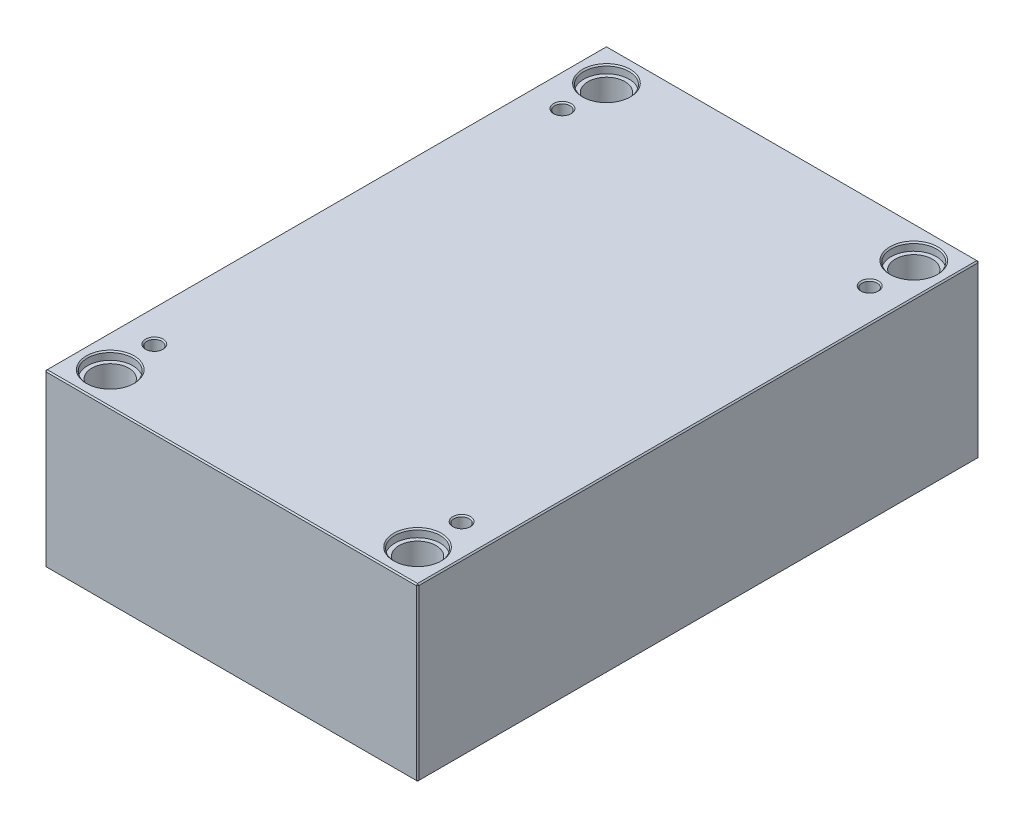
ISO-10303-21;
HEADER;
FILE_DESCRIPTION(('STEP AP214'),'2;1');
FILE_NAME('part.step','',(''),(''),'','','');
FILE_SCHEMA(('AUTOMOTIVE_DESIGN { 1 0 10303 214 1 1 1 1 }'));
ENDSEC;
DATA;
#1=APPLICATION_CONTEXT('core data for automotive mechanical design processes');
#2=APPLICATION_PROTOCOL_DEFINITION('international standard','automotive_design',2000,#1);
#3=PRODUCT_CONTEXT('',#1,'mechanical');
#4=PRODUCT('Part','Part','',(#3));
#5=PRODUCT_RELATED_PRODUCT_CATEGORY('part','',(#4));
#6=PRODUCT_DEFINITION_FORMATION('','',#4);
#7=PRODUCT_DEFINITION_CONTEXT('part definition',#1,'design');
#8=PRODUCT_DEFINITION('design','',#6,#7);
#9=PRODUCT_DEFINITION_SHAPE('','',#8);
#10=(LENGTH_UNIT() NAMED_UNIT(*) SI_UNIT(.MILLI.,.METRE.));
#11=(NAMED_UNIT(*) PLANE_ANGLE_UNIT() SI_UNIT($,.RADIAN.));
#12=(NAMED_UNIT(*) SI_UNIT($,.STERADIAN.) SOLID_ANGLE_UNIT());
#13=UNCERTAINTY_MEASURE_WITH_UNIT(LENGTH_MEASURE(1.E-05),#10,'distance_accuracy_value','');
#14=(GEOMETRIC_REPRESENTATION_CONTEXT(3) GLOBAL_UNCERTAINTY_ASSIGNED_CONTEXT((#13)) GLOBAL_UNIT_ASSIGNED_CONTEXT((#10,
#11,#12)) REPRESENTATION_CONTEXT('',''));
#15=CARTESIAN_POINT('',(0.,0.,0.));
#16=DIRECTION('',(0.,0.,1.));
#17=DIRECTION('',(1.,0.,0.));
#18=AXIS2_PLACEMENT_3D('',#15,#16,#17);
#19=CARTESIAN_POINT('',(-122.,0.,-197.));
#20=DIRECTION('',(0.,1.,0.));
#21=DIRECTION('',(0.,0.,1.));
#22=AXIS2_PLACEMENT_3D('',#19,#20,#21);
#23=CYLINDRICAL_SURFACE('',#22,14.7);
#24=CARTESIAN_POINT('',(-122.,1.00000000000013,-197.));
#25=DIRECTION('',(0.,1.,0.));
#26=DIRECTION('',(0.,0.,1.));
#27=AXIS2_PLACEMENT_3D('',#24,#25,#26);
#28=CIRCLE('',#27,14.7);
#29=CARTESIAN_POINT('',(-122.,1.00000000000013,-182.3));
#30=VERTEX_POINT('',#29);
#31=EDGE_CURVE('E471',#30,#30,#28,.F.);
#32=ORIENTED_EDGE('',*,*,#31,.T.);
#33=EDGE_LOOP('',(#32));
#34=FACE_BOUND('',#33,.T.);
#35=CARTESIAN_POINT('',(-122.,129.7,-197.));
#36=DIRECTION('',(0.,1.,0.));
#37=DIRECTION('',(0.,0.,1.));
#38=AXIS2_PLACEMENT_3D('',#35,#36,#37);
#39=CIRCLE('',#38,14.7);
#40=CARTESIAN_POINT('',(-122.,129.7,-182.3));
#41=VERTEX_POINT('',#40);
#42=EDGE_CURVE('E220',#41,#41,#39,.F.);
#43=ORIENTED_EDGE('',*,*,#42,.F.);
#44=EDGE_LOOP('',(#43));
#45=FACE_BOUND('',#44,.T.);
#46=ADVANCED_FACE('F15',(#34,#45),#23,.F.);
#47=CARTESIAN_POINT('',(122.,0.,-197.));
#48=DIRECTION('',(0.,1.,0.));
#49=DIRECTION('',(0.,0.,1.));
#50=AXIS2_PLACEMENT_3D('',#47,#48,#49);
#51=CYLINDRICAL_SURFACE('',#50,14.7);
#52=CARTESIAN_POINT('',(122.,1.00000000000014,-197.));
#53=DIRECTION('',(0.,1.,0.));
#54=DIRECTION('',(0.,0.,1.));
#55=AXIS2_PLACEMENT_3D('',#52,#53,#54);
#56=CIRCLE('',#55,14.7);
#57=CARTESIAN_POINT('',(122.,1.00000000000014,-182.3));
#58=VERTEX_POINT('',#57);
#59=EDGE_CURVE('E473',#58,#58,#56,.F.);
#60=ORIENTED_EDGE('',*,*,#59,.T.);
#61=EDGE_LOOP('',(#60));
#62=FACE_BOUND('',#61,.T.);
#63=CARTESIAN_POINT('',(122.,129.7,-197.));
#64=DIRECTION('',(0.,1.,0.));
#65=DIRECTION('',(0.,0.,1.));
#66=AXIS2_PLACEMENT_3D('',#63,#64,#65);
#67=CIRCLE('',#66,14.7);
#68=CARTESIAN_POINT('',(122.,129.7,-182.3));
#69=VERTEX_POINT('',#68);
#70=EDGE_CURVE('E217',#69,#69,#67,.F.);
#71=ORIENTED_EDGE('',*,*,#70,.F.);
#72=EDGE_LOOP('',(#71));
#73=FACE_BOUND('',#72,.T.);
#74=ADVANCED_FACE('F262',(#62,#73),#51,.F.);
#75=CARTESIAN_POINT('',(122.,0.,197.));
#76=DIRECTION('',(0.,1.,0.));
#77=DIRECTION('',(0.,0.,1.));
#78=AXIS2_PLACEMENT_3D('',#75,#76,#77);
#79=CYLINDRICAL_SURFACE('',#78,14.7);
#80=CARTESIAN_POINT('',(122.,1.00000000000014,197.));
#81=DIRECTION('',(0.,1.,0.));
#82=DIRECTION('',(0.,0.,1.));
#83=AXIS2_PLACEMENT_3D('',#80,#81,#82);
#84=CIRCLE('',#83,14.7);
#85=CARTESIAN_POINT('',(122.,1.00000000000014,211.7));
#86=VERTEX_POINT('',#85);
#87=EDGE_CURVE('E476',#86,#86,#84,.F.);
#88=ORIENTED_EDGE('',*,*,#87,.T.);
#89=EDGE_LOOP('',(#88));
#90=FACE_BOUND('',#89,.T.);
#91=CARTESIAN_POINT('',(122.,129.7,197.));
#92=DIRECTION('',(0.,1.,0.));
#93=DIRECTION('',(0.,0.,1.));
#94=AXIS2_PLACEMENT_3D('',#91,#92,#93);
#95=CIRCLE('',#94,14.7);
#96=CARTESIAN_POINT('',(122.,129.7,211.7));
#97=VERTEX_POINT('',#96);
#98=EDGE_CURVE('E213',#97,#97,#95,.F.);
#99=ORIENTED_EDGE('',*,*,#98,.F.);
#100=EDGE_LOOP('',(#99));
#101=FACE_BOUND('',#100,.T.);
#102=ADVANCED_FACE('F269',(#90,#101),#79,.F.);
#103=CARTESIAN_POINT('',(-122.,0.,197.));
#104=DIRECTION('',(0.,1.,0.));
#105=DIRECTION('',(0.,0.,1.));
#106=AXIS2_PLACEMENT_3D('',#103,#104,#105);
#107=CYLINDRICAL_SURFACE('',#106,14.7);
#108=CARTESIAN_POINT('',(-122.,0.999999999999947,197.));
#109=DIRECTION('',(0.,1.,0.));
#110=DIRECTION('',(0.,0.,1.));
#111=AXIS2_PLACEMENT_3D('',#108,#109,#110);
#112=CIRCLE('',#111,14.7);
#113=CARTESIAN_POINT('',(-122.,0.999999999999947,211.7));
#114=VERTEX_POINT('',#113);
#115=EDGE_CURVE('E479',#114,#114,#112,.F.);
#116=ORIENTED_EDGE('',*,*,#115,.T.);
#117=EDGE_LOOP('',(#116));
#118=FACE_BOUND('',#117,.T.);
#119=CARTESIAN_POINT('',(-122.,129.7,197.));
#120=DIRECTION('',(0.,1.,0.));
#121=DIRECTION('',(0.,0.,1.));
#122=AXIS2_PLACEMENT_3D('',#119,#120,#121);
#123=CIRCLE('',#122,14.7);
#124=CARTESIAN_POINT('',(-122.,129.7,211.7));
#125=VERTEX_POINT('',#124);
#126=EDGE_CURVE('E210',#125,#125,#123,.F.);
#127=ORIENTED_EDGE('',*,*,#126,.F.);
#128=EDGE_LOOP('',(#127));
#129=FACE_BOUND('',#128,.T.);
#130=ADVANCED_FACE('F276',(#118,#129),#107,.F.);
#131=CARTESIAN_POINT('',(-148.,136.,223.));
#132=DIRECTION('',(1.,0.,0.));
#133=DIRECTION('',(0.,0.,-1.));
#134=AXIS2_PLACEMENT_3D('',#131,#132,#133);
#135=PLANE('',#134);
#136=DIRECTION('',(0.,-1.,0.));
#137=VECTOR('',#136,1.);
#138=CARTESIAN_POINT('',(-148.,136.,-222.));
#139=LINE('',#138,#137);
#140=CARTESIAN_POINT('',(-148.,135.,-222.));
#141=VERTEX_POINT('',#140);
#142=CARTESIAN_POINT('',(-148.,1.00000000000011,-222.));
#143=VERTEX_POINT('',#142);
#144=EDGE_CURVE('E486',#141,#143,#139,.T.);
#145=ORIENTED_EDGE('',*,*,#144,.T.);
#146=DIRECTION('',(0.,0.,1.));
#147=VECTOR('',#146,1.);
#148=CARTESIAN_POINT('',(-148.,1.00000000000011,223.));
#149=LINE('',#148,#147);
#150=CARTESIAN_POINT('',(-148.,1.00000000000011,222.));
#151=VERTEX_POINT('',#150);
#152=EDGE_CURVE('E489',#143,#151,#149,.T.);
#153=ORIENTED_EDGE('',*,*,#152,.T.);
#154=DIRECTION('',(0.,1.,0.));
#155=VECTOR('',#154,1.);
#156=CARTESIAN_POINT('',(-148.,136.,222.));
#157=LINE('',#156,#155);
#158=CARTESIAN_POINT('',(-148.,135.,222.));
#159=VERTEX_POINT('',#158);
#160=EDGE_CURVE('E484',#151,#159,#157,.T.);
#161=ORIENTED_EDGE('',*,*,#160,.T.);
#162=DIRECTION('',(0.,0.,-1.));
#163=VECTOR('',#162,1.);
#164=CARTESIAN_POINT('',(-148.,135.,-223.));
#165=LINE('',#164,#163);
#166=EDGE_CURVE('E482',#159,#141,#165,.T.);
#167=ORIENTED_EDGE('',*,*,#166,.T.);
#168=EDGE_LOOP('',(#145,#153,#161,#167));
#169=FACE_BOUND('',#168,.T.);
#170=ADVANCED_FACE('F297',(#169),#135,.F.);
#171=CARTESIAN_POINT('',(148.,136.,223.));
#172=DIRECTION('',(0.,0.,-1.));
#173=DIRECTION('',(-1.,0.,0.));
#174=AXIS2_PLACEMENT_3D('',#171,#172,#173);
#175=PLANE('',#174);
#176=DIRECTION('',(-1.,0.,0.));
#177=VECTOR('',#176,1.);
#178=CARTESIAN_POINT('',(-148.,135.,223.));
#179=LINE('',#178,#177);
#180=CARTESIAN_POINT('',(147.,135.,223.));
#181=VERTEX_POINT('',#180);
#182=CARTESIAN_POINT('',(-147.,135.,223.));
#183=VERTEX_POINT('',#182);
#184=EDGE_CURVE('E508',#181,#183,#179,.T.);
#185=ORIENTED_EDGE('',*,*,#184,.T.);
#186=DIRECTION('',(0.,-1.,0.));
#187=VECTOR('',#186,1.);
#188=CARTESIAN_POINT('',(-147.,136.,223.));
#189=LINE('',#188,#187);
#190=CARTESIAN_POINT('',(-147.,1.00000000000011,223.));
#191=VERTEX_POINT('',#190);
#192=EDGE_CURVE('E514',#183,#191,#189,.T.);
#193=ORIENTED_EDGE('',*,*,#192,.T.);
#194=DIRECTION('',(1.,0.,0.));
#195=VECTOR('',#194,1.);
#196=CARTESIAN_POINT('',(148.,1.00000000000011,223.));
#197=LINE('',#196,#195);
#198=CARTESIAN_POINT('',(147.,1.00000000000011,223.));
#199=VERTEX_POINT('',#198);
#200=EDGE_CURVE('E512',#191,#199,#197,.T.);
#201=ORIENTED_EDGE('',*,*,#200,.T.);
#202=DIRECTION('',(0.,1.,0.));
#203=VECTOR('',#202,1.);
#204=CARTESIAN_POINT('',(147.,136.,223.));
#205=LINE('',#204,#203);
#206=EDGE_CURVE('E510',#199,#181,#205,.T.);
#207=ORIENTED_EDGE('',*,*,#206,.T.);
#208=EDGE_LOOP('',(#185,#193,#201,#207));
#209=FACE_BOUND('',#208,.T.);
#210=ADVANCED_FACE('F293',(#209),#175,.F.);
#211=CARTESIAN_POINT('',(148.,136.,223.));
#212=DIRECTION('',(-1.,0.,0.));
#213=DIRECTION('',(0.,0.,1.));
#214=AXIS2_PLACEMENT_3D('',#211,#212,#213);
#215=PLANE('',#214);
#216=DIRECTION('',(0.,0.,-1.));
#217=VECTOR('',#216,1.);
#218=CARTESIAN_POINT('',(148.,1.00000000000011,223.));
#219=LINE('',#218,#217);
#220=CARTESIAN_POINT('',(148.,1.00000000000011,222.));
#221=VERTEX_POINT('',#220);
#222=CARTESIAN_POINT('',(148.,1.00000000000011,-222.));
#223=VERTEX_POINT('',#222);
#224=EDGE_CURVE('E503',#221,#223,#219,.T.);
#225=ORIENTED_EDGE('',*,*,#224,.T.);
#226=DIRECTION('',(0.,1.,0.));
#227=VECTOR('',#226,1.);
#228=CARTESIAN_POINT('',(148.,136.,-222.));
#229=LINE('',#228,#227);
#230=CARTESIAN_POINT('',(148.,135.,-222.));
#231=VERTEX_POINT('',#230);
#232=EDGE_CURVE('E505',#223,#231,#229,.T.);
#233=ORIENTED_EDGE('',*,*,#232,.T.);
#234=DIRECTION('',(0.,0.,1.));
#235=VECTOR('',#234,1.);
#236=CARTESIAN_POINT('',(148.,135.,223.));
#237=LINE('',#236,#235);
#238=CARTESIAN_POINT('',(148.,135.,222.));
#239=VERTEX_POINT('',#238);
#240=EDGE_CURVE('E499',#231,#239,#237,.T.);
#241=ORIENTED_EDGE('',*,*,#240,.T.);
#242=DIRECTION('',(0.,-1.,0.));
#243=VECTOR('',#242,1.);
#244=CARTESIAN_POINT('',(148.,136.,222.));
#245=LINE('',#244,#243);
#246=EDGE_CURVE('E501',#239,#221,#245,.T.);
#247=ORIENTED_EDGE('',*,*,#246,.T.);
#248=EDGE_LOOP('',(#225,#233,#241,#247));
#249=FACE_BOUND('',#248,.T.);
#250=ADVANCED_FACE('F289',(#249),#215,.F.);
#251=CARTESIAN_POINT('',(148.,136.,-223.));
#252=DIRECTION('',(0.,0.,1.));
#253=DIRECTION('',(1.,0.,0.));
#254=AXIS2_PLACEMENT_3D('',#251,#252,#253);
#255=PLANE('',#254);
#256=DIRECTION('',(0.,-1.,0.));
#257=VECTOR('',#256,1.);
#258=CARTESIAN_POINT('',(147.,136.,-223.));
#259=LINE('',#258,#257);
#260=CARTESIAN_POINT('',(147.,135.,-223.));
#261=VERTEX_POINT('',#260);
#262=CARTESIAN_POINT('',(147.,1.00000000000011,-223.));
#263=VERTEX_POINT('',#262);
#264=EDGE_CURVE('E493',#261,#263,#259,.T.);
#265=ORIENTED_EDGE('',*,*,#264,.T.);
#266=DIRECTION('',(-1.,0.,0.));
#267=VECTOR('',#266,1.);
#268=CARTESIAN_POINT('',(148.,1.00000000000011,-223.));
#269=LINE('',#268,#267);
#270=CARTESIAN_POINT('',(-147.,1.00000000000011,-223.));
#271=VERTEX_POINT('',#270);
#272=EDGE_CURVE('E137',#263,#271,#269,.T.);
#273=ORIENTED_EDGE('',*,*,#272,.T.);
#274=DIRECTION('',(0.,1.,0.));
#275=VECTOR('',#274,1.);
#276=CARTESIAN_POINT('',(-147.,136.,-223.));
#277=LINE('',#276,#275);
#278=CARTESIAN_POINT('',(-147.,135.,-223.));
#279=VERTEX_POINT('',#278);
#280=EDGE_CURVE('E495',#271,#279,#277,.T.);
#281=ORIENTED_EDGE('',*,*,#280,.T.);
#282=DIRECTION('',(1.,0.,0.));
#283=VECTOR('',#282,1.);
#284=CARTESIAN_POINT('',(148.,135.,-223.));
#285=LINE('',#284,#283);
#286=EDGE_CURVE('E491',#279,#261,#285,.T.);
#287=ORIENTED_EDGE('',*,*,#286,.T.);
#288=EDGE_LOOP('',(#265,#273,#281,#287));
#289=FACE_BOUND('',#288,.T.);
#290=ADVANCED_FACE('F281',(#289),#255,.F.);
#291=CARTESIAN_POINT('',(0.,136.,0.));
#292=DIRECTION('',(0.,1.,0.));
#293=DIRECTION('',(0.,0.,1.));
#294=AXIS2_PLACEMENT_3D('',#291,#292,#293);
#295=PLANE('',#294);
#296=CARTESIAN_POINT('',(122.,136.,197.));
#297=DIRECTION('',(0.,1.,0.));
#298=DIRECTION('',(0.,0.,1.));
#299=AXIS2_PLACEMENT_3D('',#296,#297,#298);
#300=CIRCLE('',#299,19.);
#301=CARTESIAN_POINT('',(122.,136.,216.));
#302=VERTEX_POINT('',#301);
#303=EDGE_CURVE('E235',#302,#302,#300,.F.);
#304=ORIENTED_EDGE('',*,*,#303,.T.);
#305=EDGE_LOOP('',(#304));
#306=FACE_BOUND('',#305,.T.);
#307=CARTESIAN_POINT('',(-122.,136.,197.));
#308=DIRECTION('',(0.,1.,0.));
#309=DIRECTION('',(0.,0.,1.));
#310=AXIS2_PLACEMENT_3D('',#307,#308,#309);
#311=CIRCLE('',#310,19.);
#312=CARTESIAN_POINT('',(-122.,136.,216.));
#313=VERTEX_POINT('',#312);
#314=EDGE_CURVE('E232',#313,#313,#311,.F.);
#315=ORIENTED_EDGE('',*,*,#314,.T.);
#316=EDGE_LOOP('',(#315));
#317=FACE_BOUND('',#316,.T.);
#318=CARTESIAN_POINT('',(122.,136.,-197.));
#319=DIRECTION('',(0.,1.,0.));
#320=DIRECTION('',(0.,0.,1.));
#321=AXIS2_PLACEMENT_3D('',#318,#319,#320);
#322=CIRCLE('',#321,19.);
#323=CARTESIAN_POINT('',(122.,136.,-178.));
#324=VERTEX_POINT('',#323);
#325=EDGE_CURVE('E229',#324,#324,#322,.F.);
#326=ORIENTED_EDGE('',*,*,#325,.T.);
#327=EDGE_LOOP('',(#326));
#328=FACE_BOUND('',#327,.T.);
#329=CARTESIAN_POINT('',(-122.,136.,-197.));
#330=DIRECTION('',(0.,1.,0.));
#331=DIRECTION('',(0.,0.,1.));
#332=AXIS2_PLACEMENT_3D('',#329,#330,#331);
#333=CIRCLE('',#332,19.);
#334=CARTESIAN_POINT('',(-122.,136.,-178.));
#335=VERTEX_POINT('',#334);
#336=EDGE_CURVE('E226',#335,#335,#333,.F.);
#337=ORIENTED_EDGE('',*,*,#336,.T.);
#338=EDGE_LOOP('',(#337));
#339=FACE_BOUND('',#338,.T.);
#340=CARTESIAN_POINT('',(-122.,136.,162.));
#341=DIRECTION('',(0.,1.,0.));
#342=DIRECTION('',(0.,0.,1.));
#343=AXIS2_PLACEMENT_3D('',#340,#341,#342);
#344=CIRCLE('',#343,7.);
#345=CARTESIAN_POINT('',(-122.,136.,169.));
#346=VERTEX_POINT('',#345);
#347=EDGE_CURVE('E197',#346,#346,#344,.F.);
#348=ORIENTED_EDGE('',*,*,#347,.T.);
#349=EDGE_LOOP('',(#348));
#350=FACE_BOUND('',#349,.T.);
#351=CARTESIAN_POINT('',(122.,136.,162.));
#352=DIRECTION('',(0.,1.,0.));
#353=DIRECTION('',(0.,0.,1.));
#354=AXIS2_PLACEMENT_3D('',#351,#352,#353);
#355=CIRCLE('',#354,7.);
#356=CARTESIAN_POINT('',(122.,136.,169.));
#357=VERTEX_POINT('',#356);
#358=EDGE_CURVE('E194',#357,#357,#355,.F.);
#359=ORIENTED_EDGE('',*,*,#358,.T.);
#360=EDGE_LOOP('',(#359));
#361=FACE_BOUND('',#360,.T.);
#362=CARTESIAN_POINT('',(122.,136.,-162.));
#363=DIRECTION('',(0.,1.,0.));
#364=DIRECTION('',(0.,0.,1.));
#365=AXIS2_PLACEMENT_3D('',#362,#363,#364);
#366=CIRCLE('',#365,7.);
#367=CARTESIAN_POINT('',(122.,136.,-155.));
#368=VERTEX_POINT('',#367);
#369=EDGE_CURVE('E191',#368,#368,#366,.F.);
#370=ORIENTED_EDGE('',*,*,#369,.T.);
#371=EDGE_LOOP('',(#370));
#372=FACE_BOUND('',#371,.T.);
#373=CARTESIAN_POINT('',(-122.,136.,-162.));
#374=DIRECTION('',(0.,1.,0.));
#375=DIRECTION('',(0.,0.,1.));
#376=AXIS2_PLACEMENT_3D('',#373,#374,#375);
#377=CIRCLE('',#376,7.);
#378=CARTESIAN_POINT('',(-122.,136.,-155.));
#379=VERTEX_POINT('',#378);
#380=EDGE_CURVE('E187',#379,#379,#377,.F.);
#381=ORIENTED_EDGE('',*,*,#380,.T.);
#382=EDGE_LOOP('',(#381));
#383=FACE_BOUND('',#382,.T.);
#384=DIRECTION('',(0.,0.,-1.));
#385=VECTOR('',#384,1.);
#386=CARTESIAN_POINT('',(147.,136.,-223.));
#387=LINE('',#386,#385);
#388=CARTESIAN_POINT('',(147.,136.,222.));
#389=VERTEX_POINT('',#388);
#390=CARTESIAN_POINT('',(147.,136.,-222.));
#391=VERTEX_POINT('',#390);
#392=EDGE_CURVE('E30',#389,#391,#387,.T.);
#393=ORIENTED_EDGE('',*,*,#392,.T.);
#394=DIRECTION('',(-1.,0.,0.));
#395=VECTOR('',#394,1.);
#396=CARTESIAN_POINT('',(-148.,136.,-222.));
#397=LINE('',#396,#395);
#398=CARTESIAN_POINT('',(-147.,136.,-222.));
#399=VERTEX_POINT('',#398);
#400=EDGE_CURVE('E188',#391,#399,#397,.T.);
#401=ORIENTED_EDGE('',*,*,#400,.T.);
#402=DIRECTION('',(0.,0.,1.));
#403=VECTOR('',#402,1.);
#404=CARTESIAN_POINT('',(-147.,136.,223.));
#405=LINE('',#404,#403);
#406=CARTESIAN_POINT('',(-147.,136.,222.));
#407=VERTEX_POINT('',#406);
#408=EDGE_CURVE('E517',#399,#407,#405,.T.);
#409=ORIENTED_EDGE('',*,*,#408,.T.);
#410=DIRECTION('',(1.,0.,0.));
#411=VECTOR('',#410,1.);
#412=CARTESIAN_POINT('',(148.,136.,222.));
#413=LINE('',#412,#411);
#414=EDGE_CURVE('E35',#407,#389,#413,.T.);
#415=ORIENTED_EDGE('',*,*,#414,.T.);
#416=EDGE_LOOP('',(#393,#401,#409,#415));
#417=FACE_BOUND('',#416,.T.);
#418=ADVANCED_FACE('F278',(#306,#317,#328,#339,#350,#361,#372,#383,#417),#295,.T.);
#419=CARTESIAN_POINT('',(0.,0.,0.));
#420=DIRECTION('',(0.,1.,0.));
#421=DIRECTION('',(0.,0.,1.));
#422=AXIS2_PLACEMENT_3D('',#419,#420,#421);
#423=PLANE('',#422);
#424=CARTESIAN_POINT('',(-122.,0.,-197.));
#425=DIRECTION('',(0.,1.,0.));
#426=DIRECTION('',(0.,0.,1.));
#427=AXIS2_PLACEMENT_3D('',#424,#425,#426);
#428=CIRCLE('',#427,15.7);
#429=CARTESIAN_POINT('',(-122.,0.,-181.3));
#430=VERTEX_POINT('',#429);
#431=EDGE_CURVE('E468',#430,#430,#428,.T.);
#432=ORIENTED_EDGE('',*,*,#431,.T.);
#433=EDGE_LOOP('',(#432));
#434=FACE_BOUND('',#433,.T.);
#435=CARTESIAN_POINT('',(122.,0.,-197.));
#436=DIRECTION('',(0.,1.,0.));
#437=DIRECTION('',(0.,0.,1.));
#438=AXIS2_PLACEMENT_3D('',#435,#436,#437);
#439=CIRCLE('',#438,15.7);
#440=CARTESIAN_POINT('',(122.,0.,-181.3));
#441=VERTEX_POINT('',#440);
#442=EDGE_CURVE('E465',#441,#441,#439,.T.);
#443=ORIENTED_EDGE('',*,*,#442,.T.);
#444=EDGE_LOOP('',(#443));
#445=FACE_BOUND('',#444,.T.);
#446=CARTESIAN_POINT('',(122.,0.,197.));
#447=DIRECTION('',(0.,1.,0.));
#448=DIRECTION('',(0.,0.,1.));
#449=AXIS2_PLACEMENT_3D('',#446,#447,#448);
#450=CIRCLE('',#449,15.7);
#451=CARTESIAN_POINT('',(122.,0.,212.7));
#452=VERTEX_POINT('',#451);
#453=EDGE_CURVE('E462',#452,#452,#450,.T.);
#454=ORIENTED_EDGE('',*,*,#453,.T.);
#455=EDGE_LOOP('',(#454));
#456=FACE_BOUND('',#455,.T.);
#457=CARTESIAN_POINT('',(-122.,0.,197.));
#458=DIRECTION('',(0.,1.,0.));
#459=DIRECTION('',(0.,0.,1.));
#460=AXIS2_PLACEMENT_3D('',#457,#458,#459);
#461=CIRCLE('',#460,15.7);
#462=CARTESIAN_POINT('',(-122.,0.,212.7));
#463=VERTEX_POINT('',#462);
#464=EDGE_CURVE('E459',#463,#463,#461,.T.);
#465=ORIENTED_EDGE('',*,*,#464,.T.);
#466=EDGE_LOOP('',(#465));
#467=FACE_BOUND('',#466,.T.);
#468=DIRECTION('',(0.,0.,1.));
#469=VECTOR('',#468,1.);
#470=CARTESIAN_POINT('',(147.,0.,0.));
#471=LINE('',#470,#469);
#472=CARTESIAN_POINT('',(147.,0.,-222.));
#473=VERTEX_POINT('',#472);
#474=CARTESIAN_POINT('',(147.,0.,222.));
#475=VERTEX_POINT('',#474);
#476=EDGE_CURVE('E107',#473,#475,#471,.T.);
#477=ORIENTED_EDGE('',*,*,#476,.T.);
#478=DIRECTION('',(-1.,0.,0.));
#479=VECTOR('',#478,1.);
#480=CARTESIAN_POINT('',(0.,0.,222.));
#481=LINE('',#480,#479);
#482=CARTESIAN_POINT('',(-147.,0.,222.));
#483=VERTEX_POINT('',#482);
#484=EDGE_CURVE('E457',#475,#483,#481,.T.);
#485=ORIENTED_EDGE('',*,*,#484,.T.);
#486=DIRECTION('',(0.,0.,-1.));
#487=VECTOR('',#486,1.);
#488=CARTESIAN_POINT('',(-147.,0.,0.));
#489=LINE('',#488,#487);
#490=CARTESIAN_POINT('',(-147.,0.,-222.));
#491=VERTEX_POINT('',#490);
#492=EDGE_CURVE('E109',#483,#491,#489,.T.);
#493=ORIENTED_EDGE('',*,*,#492,.T.);
#494=DIRECTION('',(1.,0.,0.));
#495=VECTOR('',#494,1.);
#496=CARTESIAN_POINT('',(0.,0.,-222.));
#497=LINE('',#496,#495);
#498=EDGE_CURVE('E103',#491,#473,#497,.T.);
#499=ORIENTED_EDGE('',*,*,#498,.T.);
#500=EDGE_LOOP('',(#477,#485,#493,#499));
#501=FACE_BOUND('',#500,.T.);
#502=ADVANCED_FACE('F105',(#434,#445,#456,#467,#501),#423,.F.);
#503=CARTESIAN_POINT('',(-122.,0.,-197.));
#504=DIRECTION('',(0.,-1.,0.));
#505=DIRECTION('',(0.,0.,-1.));
#506=AXIS2_PLACEMENT_3D('',#503,#504,#505);
#507=CONICAL_SURFACE('',#506,15.7,0.785398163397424);
#508=ORIENTED_EDGE('',*,*,#31,.F.);
#509=EDGE_LOOP('',(#508));
#510=FACE_BOUND('',#509,.T.);
#511=ORIENTED_EDGE('',*,*,#431,.F.);
#512=EDGE_LOOP('',(#511));
#513=FACE_BOUND('',#512,.T.);
#514=ADVANCED_FACE('F285',(#510,#513),#507,.F.);
#515=CARTESIAN_POINT('',(122.,0.,-197.));
#516=DIRECTION('',(0.,-1.,0.));
#517=DIRECTION('',(0.,0.,-1.));
#518=AXIS2_PLACEMENT_3D('',#515,#516,#517);
#519=CONICAL_SURFACE('',#518,15.7,0.785398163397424);
#520=ORIENTED_EDGE('',*,*,#59,.F.);
#521=EDGE_LOOP('',(#520));
#522=FACE_BOUND('',#521,.T.);
#523=ORIENTED_EDGE('',*,*,#442,.F.);
#524=EDGE_LOOP('',(#523));
#525=FACE_BOUND('',#524,.T.);
#526=ADVANCED_FACE('F304',(#522,#525),#519,.F.);
#527=CARTESIAN_POINT('',(122.,0.,197.));
#528=DIRECTION('',(0.,-1.,0.));
#529=DIRECTION('',(0.,0.,-1.));
#530=AXIS2_PLACEMENT_3D('',#527,#528,#529);
#531=CONICAL_SURFACE('',#530,15.7,0.785398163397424);
#532=ORIENTED_EDGE('',*,*,#87,.F.);
#533=EDGE_LOOP('',(#532));
#534=FACE_BOUND('',#533,.T.);
#535=ORIENTED_EDGE('',*,*,#453,.F.);
#536=EDGE_LOOP('',(#535));
#537=FACE_BOUND('',#536,.T.);
#538=ADVANCED_FACE('F308',(#534,#537),#531,.F.);
#539=CARTESIAN_POINT('',(-122.,0.,197.));
#540=DIRECTION('',(0.,-1.,0.));
#541=DIRECTION('',(0.,0.,-1.));
#542=AXIS2_PLACEMENT_3D('',#539,#540,#541);
#543=CONICAL_SURFACE('',#542,15.7,0.785398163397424);
#544=ORIENTED_EDGE('',*,*,#115,.F.);
#545=EDGE_LOOP('',(#544));
#546=FACE_BOUND('',#545,.T.);
#547=ORIENTED_EDGE('',*,*,#464,.F.);
#548=EDGE_LOOP('',(#547));
#549=FACE_BOUND('',#548,.T.);
#550=ADVANCED_FACE('F312',(#546,#549),#543,.F.);
#551=CARTESIAN_POINT('',(148.,136.,222.));
#552=DIRECTION('',(-0.707106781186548,0.,-0.707106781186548));
#553=DIRECTION('',(0.,-1.,0.));
#554=AXIS2_PLACEMENT_3D('',#551,#552,#553);
#555=PLANE('',#554);
#556=DIRECTION('',(-0.707106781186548,0.,0.707106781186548));
#557=VECTOR('',#556,1.);
#558=CARTESIAN_POINT('',(147.,135.,223.));
#559=LINE('',#558,#557);
#560=EDGE_CURVE('E125',#181,#239,#559,.F.);
#561=ORIENTED_EDGE('',*,*,#560,.F.);
#562=ORIENTED_EDGE('',*,*,#206,.F.);
#563=DIRECTION('',(0.707106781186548,0.,-0.707106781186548));
#564=VECTOR('',#563,1.);
#565=CARTESIAN_POINT('',(147.,1.00000000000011,223.));
#566=LINE('',#565,#564);
#567=EDGE_CURVE('E179',#221,#199,#566,.F.);
#568=ORIENTED_EDGE('',*,*,#567,.F.);
#569=ORIENTED_EDGE('',*,*,#246,.F.);
#570=EDGE_LOOP('',(#561,#562,#568,#569));
#571=FACE_BOUND('',#570,.T.);
#572=ADVANCED_FACE('F316',(#571),#555,.F.);
#573=CARTESIAN_POINT('',(147.,135.,223.));
#574=DIRECTION('',(0.577350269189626,0.577350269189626,0.577350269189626));
#575=DIRECTION('',(0.707106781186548,0.,-0.707106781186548));
#576=AXIS2_PLACEMENT_3D('',#573,#574,#575);
#577=PLANE('',#576);
#578=DIRECTION('',(0.,-0.707106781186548,0.707106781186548));
#579=VECTOR('',#578,1.);
#580=CARTESIAN_POINT('',(147.,135.,223.));
#581=LINE('',#580,#579);
#582=EDGE_CURVE('E174',#181,#389,#581,.F.);
#583=ORIENTED_EDGE('',*,*,#582,.F.);
#584=ORIENTED_EDGE('',*,*,#560,.T.);
#585=DIRECTION('',(-0.707106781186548,0.707106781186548,0.));
#586=VECTOR('',#585,1.);
#587=CARTESIAN_POINT('',(147.5,135.5,222.));
#588=LINE('',#587,#586);
#589=EDGE_CURVE('E176',#389,#239,#588,.F.);
#590=ORIENTED_EDGE('',*,*,#589,.F.);
#591=EDGE_LOOP('',(#583,#584,#590));
#592=FACE_BOUND('',#591,.T.);
#593=ADVANCED_FACE('F384',(#592),#577,.T.);
#594=CARTESIAN_POINT('',(147.,1.00000000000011,223.));
#595=DIRECTION('',(0.577350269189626,-0.577350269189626,0.577350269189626));
#596=DIRECTION('',(0.707106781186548,0.,-0.707106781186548));
#597=AXIS2_PLACEMENT_3D('',#594,#595,#596);
#598=PLANE('',#597);
#599=DIRECTION('',(-0.707106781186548,-0.707106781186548,0.));
#600=VECTOR('',#599,1.);
#601=CARTESIAN_POINT('',(147.5,0.500000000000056,222.));
#602=LINE('',#601,#600);
#603=EDGE_CURVE('E123',#221,#475,#602,.T.);
#604=ORIENTED_EDGE('',*,*,#603,.F.);
#605=ORIENTED_EDGE('',*,*,#567,.T.);
#606=DIRECTION('',(0.,0.707106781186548,0.707106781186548));
#607=VECTOR('',#606,1.);
#608=CARTESIAN_POINT('',(147.,1.00000000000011,223.));
#609=LINE('',#608,#607);
#610=EDGE_CURVE('E171',#475,#199,#609,.T.);
#611=ORIENTED_EDGE('',*,*,#610,.F.);
#612=EDGE_LOOP('',(#604,#605,#611));
#613=FACE_BOUND('',#612,.T.);
#614=ADVANCED_FACE('F380',(#613),#598,.T.);
#615=CARTESIAN_POINT('',(147.,136.,0.));
#616=DIRECTION('',(0.707106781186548,0.707106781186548,0.));
#617=DIRECTION('',(0.,0.,1.));
#618=AXIS2_PLACEMENT_3D('',#615,#616,#617);
#619=PLANE('',#618);
#620=ORIENTED_EDGE('',*,*,#589,.T.);
#621=ORIENTED_EDGE('',*,*,#240,.F.);
#622=DIRECTION('',(0.707106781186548,-0.707106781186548,0.));
#623=VECTOR('',#622,1.);
#624=CARTESIAN_POINT('',(148.,135.,-222.));
#625=LINE('',#624,#623);
#626=EDGE_CURVE('E165',#391,#231,#625,.T.);
#627=ORIENTED_EDGE('',*,*,#626,.F.);
#628=ORIENTED_EDGE('',*,*,#392,.F.);
#629=EDGE_LOOP('',(#620,#621,#627,#628));
#630=FACE_BOUND('',#629,.T.);
#631=ADVANCED_FACE('F376',(#630),#619,.T.);
#632=CARTESIAN_POINT('',(0.,136.,222.));
#633=DIRECTION('',(0.,0.707106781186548,0.707106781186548));
#634=DIRECTION('',(-1.,0.,0.));
#635=AXIS2_PLACEMENT_3D('',#632,#633,#634);
#636=PLANE('',#635);
#637=ORIENTED_EDGE('',*,*,#582,.T.);
#638=ORIENTED_EDGE('',*,*,#414,.F.);
#639=DIRECTION('',(0.,0.707106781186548,-0.707106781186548));
#640=VECTOR('',#639,1.);
#641=CARTESIAN_POINT('',(-147.,135.5,222.5));
#642=LINE('',#641,#640);
#643=EDGE_CURVE('E162',#183,#407,#642,.T.);
#644=ORIENTED_EDGE('',*,*,#643,.F.);
#645=ORIENTED_EDGE('',*,*,#184,.F.);
#646=EDGE_LOOP('',(#637,#638,#644,#645));
#647=FACE_BOUND('',#646,.T.);
#648=ADVANCED_FACE('F372',(#647),#636,.T.);
#649=CARTESIAN_POINT('',(-147.,136.,223.));
#650=DIRECTION('',(0.707106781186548,0.,-0.707106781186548));
#651=DIRECTION('',(0.,-1.,0.));
#652=AXIS2_PLACEMENT_3D('',#649,#650,#651);
#653=PLANE('',#652);
#654=DIRECTION('',(0.707106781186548,0.,0.707106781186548));
#655=VECTOR('',#654,1.);
#656=CARTESIAN_POINT('',(-147.,1.00000000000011,223.));
#657=LINE('',#656,#655);
#658=EDGE_CURVE('E156',#191,#151,#657,.F.);
#659=ORIENTED_EDGE('',*,*,#658,.F.);
#660=ORIENTED_EDGE('',*,*,#192,.F.);
#661=DIRECTION('',(-0.707106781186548,0.,-0.707106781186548));
#662=VECTOR('',#661,1.);
#663=CARTESIAN_POINT('',(-148.,135.,222.));
#664=LINE('',#663,#662);
#665=EDGE_CURVE('E159',#159,#183,#664,.F.);
#666=ORIENTED_EDGE('',*,*,#665,.F.);
#667=ORIENTED_EDGE('',*,*,#160,.F.);
#668=EDGE_LOOP('',(#659,#660,#666,#667));
#669=FACE_BOUND('',#668,.T.);
#670=ADVANCED_FACE('F368',(#669),#653,.F.);
#671=CARTESIAN_POINT('',(148.,1.00000000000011,223.));
#672=DIRECTION('',(0.,0.707106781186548,-0.707106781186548));
#673=DIRECTION('',(1.,0.,0.));
#674=AXIS2_PLACEMENT_3D('',#671,#672,#673);
#675=PLANE('',#674);
#676=ORIENTED_EDGE('',*,*,#610,.T.);
#677=ORIENTED_EDGE('',*,*,#200,.F.);
#678=DIRECTION('',(0.,-0.707106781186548,-0.707106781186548));
#679=VECTOR('',#678,1.);
#680=CARTESIAN_POINT('',(-147.,1.00000000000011,223.));
#681=LINE('',#680,#679);
#682=EDGE_CURVE('E134',#483,#191,#681,.F.);
#683=ORIENTED_EDGE('',*,*,#682,.F.);
#684=ORIENTED_EDGE('',*,*,#484,.F.);
#685=EDGE_LOOP('',(#676,#677,#683,#684));
#686=FACE_BOUND('',#685,.T.);
#687=ADVANCED_FACE('F365',(#686),#675,.F.);
#688=CARTESIAN_POINT('',(148.,1.00000000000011,223.));
#689=DIRECTION('',(-0.707106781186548,0.707106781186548,0.));
#690=DIRECTION('',(0.,0.,-1.));
#691=AXIS2_PLACEMENT_3D('',#688,#689,#690);
#692=PLANE('',#691);
#693=ORIENTED_EDGE('',*,*,#603,.T.);
#694=ORIENTED_EDGE('',*,*,#476,.F.);
#695=DIRECTION('',(0.707106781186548,0.707106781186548,0.));
#696=VECTOR('',#695,1.);
#697=CARTESIAN_POINT('',(147.5,0.500000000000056,-222.));
#698=LINE('',#697,#696);
#699=EDGE_CURVE('E120',#223,#473,#698,.F.);
#700=ORIENTED_EDGE('',*,*,#699,.F.);
#701=ORIENTED_EDGE('',*,*,#224,.F.);
#702=EDGE_LOOP('',(#693,#694,#700,#701));
#703=FACE_BOUND('',#702,.T.);
#704=ADVANCED_FACE('F118',(#703),#692,.F.);
#705=CARTESIAN_POINT('',(147.,136.,-223.));
#706=DIRECTION('',(-0.707106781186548,0.,0.707106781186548));
#707=DIRECTION('',(0.,-1.,0.));
#708=AXIS2_PLACEMENT_3D('',#705,#706,#707);
#709=PLANE('',#708);
#710=DIRECTION('',(0.707106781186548,0.,0.707106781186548));
#711=VECTOR('',#710,1.);
#712=CARTESIAN_POINT('',(148.,135.,-222.));
#713=LINE('',#712,#711);
#714=EDGE_CURVE('E167',#231,#261,#713,.F.);
#715=ORIENTED_EDGE('',*,*,#714,.F.);
#716=ORIENTED_EDGE('',*,*,#232,.F.);
#717=DIRECTION('',(-0.707106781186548,0.,-0.707106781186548));
#718=VECTOR('',#717,1.);
#719=CARTESIAN_POINT('',(147.,1.00000000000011,-223.));
#720=LINE('',#719,#718);
#721=EDGE_CURVE('E133',#263,#223,#720,.F.);
#722=ORIENTED_EDGE('',*,*,#721,.F.);
#723=ORIENTED_EDGE('',*,*,#264,.F.);
#724=EDGE_LOOP('',(#715,#716,#722,#723));
#725=FACE_BOUND('',#724,.T.);
#726=ADVANCED_FACE('F358',(#725),#709,.F.);
#727=CARTESIAN_POINT('',(148.,135.,-222.));
#728=DIRECTION('',(0.577350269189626,0.577350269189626,-0.577350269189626));
#729=DIRECTION('',(-0.707106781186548,0.,-0.707106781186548));
#730=AXIS2_PLACEMENT_3D('',#727,#728,#729);
#731=PLANE('',#730);
#732=ORIENTED_EDGE('',*,*,#626,.T.);
#733=ORIENTED_EDGE('',*,*,#714,.T.);
#734=DIRECTION('',(0.,0.707106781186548,0.707106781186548));
#735=VECTOR('',#734,1.);
#736=CARTESIAN_POINT('',(147.,135.5,-222.5));
#737=LINE('',#736,#735);
#738=EDGE_CURVE('E151',#391,#261,#737,.F.);
#739=ORIENTED_EDGE('',*,*,#738,.F.);
#740=EDGE_LOOP('',(#732,#733,#739));
#741=FACE_BOUND('',#740,.T.);
#742=ADVANCED_FACE('F354',(#741),#731,.T.);
#743=CARTESIAN_POINT('',(-148.,135.,222.));
#744=DIRECTION('',(-0.577350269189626,0.577350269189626,0.577350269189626));
#745=DIRECTION('',(0.707106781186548,0.,0.707106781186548));
#746=AXIS2_PLACEMENT_3D('',#743,#744,#745);
#747=PLANE('',#746);
#748=ORIENTED_EDGE('',*,*,#665,.T.);
#749=ORIENTED_EDGE('',*,*,#643,.T.);
#750=DIRECTION('',(-0.707106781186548,-0.707106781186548,0.));
#751=VECTOR('',#750,1.);
#752=CARTESIAN_POINT('',(-148.,135.,222.));
#753=LINE('',#752,#751);
#754=EDGE_CURVE('E142',#159,#407,#753,.F.);
#755=ORIENTED_EDGE('',*,*,#754,.F.);
#756=EDGE_LOOP('',(#748,#749,#755));
#757=FACE_BOUND('',#756,.T.);
#758=ADVANCED_FACE('F350',(#757),#747,.T.);
#759=CARTESIAN_POINT('',(-147.,1.00000000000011,223.));
#760=DIRECTION('',(-0.577350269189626,-0.577350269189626,0.577350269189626));
#761=DIRECTION('',(0.707106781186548,0.,0.707106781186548));
#762=AXIS2_PLACEMENT_3D('',#759,#760,#761);
#763=PLANE('',#762);
#764=ORIENTED_EDGE('',*,*,#682,.T.);
#765=ORIENTED_EDGE('',*,*,#658,.T.);
#766=DIRECTION('',(-0.707106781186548,0.707106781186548,0.));
#767=VECTOR('',#766,1.);
#768=CARTESIAN_POINT('',(-147.5,0.500000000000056,222.));
#769=LINE('',#768,#767);
#770=EDGE_CURVE('E138',#483,#151,#769,.T.);
#771=ORIENTED_EDGE('',*,*,#770,.F.);
#772=EDGE_LOOP('',(#764,#765,#771));
#773=FACE_BOUND('',#772,.T.);
#774=ADVANCED_FACE('F347',(#773),#763,.T.);
#775=CARTESIAN_POINT('',(147.,1.00000000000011,-223.));
#776=DIRECTION('',(0.577350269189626,-0.577350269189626,-0.577350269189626));
#777=DIRECTION('',(-0.707106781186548,0.,-0.707106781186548));
#778=AXIS2_PLACEMENT_3D('',#775,#776,#777);
#779=PLANE('',#778);
#780=ORIENTED_EDGE('',*,*,#721,.T.);
#781=ORIENTED_EDGE('',*,*,#699,.T.);
#782=DIRECTION('',(0.,-0.707106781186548,0.707106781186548));
#783=VECTOR('',#782,1.);
#784=CARTESIAN_POINT('',(147.,1.00000000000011,-223.));
#785=LINE('',#784,#783);
#786=EDGE_CURVE('E130',#263,#473,#785,.T.);
#787=ORIENTED_EDGE('',*,*,#786,.F.);
#788=EDGE_LOOP('',(#780,#781,#787));
#789=FACE_BOUND('',#788,.T.);
#790=ADVANCED_FACE('F129',(#789),#779,.T.);
#791=CARTESIAN_POINT('',(0.,136.,-222.));
#792=DIRECTION('',(0.,0.707106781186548,-0.707106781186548));
#793=DIRECTION('',(1.,0.,0.));
#794=AXIS2_PLACEMENT_3D('',#791,#792,#793);
#795=PLANE('',#794);
#796=ORIENTED_EDGE('',*,*,#738,.T.);
#797=ORIENTED_EDGE('',*,*,#286,.F.);
#798=DIRECTION('',(0.,-0.707106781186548,-0.707106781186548));
#799=VECTOR('',#798,1.);
#800=CARTESIAN_POINT('',(-147.,135.,-223.));
#801=LINE('',#800,#799);
#802=EDGE_CURVE('E139',#399,#279,#801,.T.);
#803=ORIENTED_EDGE('',*,*,#802,.F.);
#804=ORIENTED_EDGE('',*,*,#400,.F.);
#805=EDGE_LOOP('',(#796,#797,#803,#804));
#806=FACE_BOUND('',#805,.T.);
#807=ADVANCED_FACE('F340',(#806),#795,.T.);
#808=CARTESIAN_POINT('',(-147.,136.,0.));
#809=DIRECTION('',(-0.707106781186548,0.707106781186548,0.));
#810=DIRECTION('',(0.,0.,-1.));
#811=AXIS2_PLACEMENT_3D('',#808,#809,#810);
#812=PLANE('',#811);
#813=ORIENTED_EDGE('',*,*,#754,.T.);
#814=ORIENTED_EDGE('',*,*,#408,.F.);
#815=DIRECTION('',(0.707106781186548,0.707106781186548,0.));
#816=VECTOR('',#815,1.);
#817=CARTESIAN_POINT('',(-147.5,135.5,-222.));
#818=LINE('',#817,#816);
#819=EDGE_CURVE('E145',#141,#399,#818,.T.);
#820=ORIENTED_EDGE('',*,*,#819,.F.);
#821=ORIENTED_EDGE('',*,*,#166,.F.);
#822=EDGE_LOOP('',(#813,#814,#820,#821));
#823=FACE_BOUND('',#822,.T.);
#824=ADVANCED_FACE('F336',(#823),#812,.T.);
#825=CARTESIAN_POINT('',(-148.,1.00000000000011,223.));
#826=DIRECTION('',(0.707106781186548,0.707106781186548,0.));
#827=DIRECTION('',(0.,0.,1.));
#828=AXIS2_PLACEMENT_3D('',#825,#826,#827);
#829=PLANE('',#828);
#830=ORIENTED_EDGE('',*,*,#770,.T.);
#831=ORIENTED_EDGE('',*,*,#152,.F.);
#832=DIRECTION('',(0.707106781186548,-0.707106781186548,0.));
#833=VECTOR('',#832,1.);
#834=CARTESIAN_POINT('',(-148.,1.00000000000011,-222.));
#835=LINE('',#834,#833);
#836=EDGE_CURVE('E528',#491,#143,#835,.F.);
#837=ORIENTED_EDGE('',*,*,#836,.F.);
#838=ORIENTED_EDGE('',*,*,#492,.F.);
#839=EDGE_LOOP('',(#830,#831,#837,#838));
#840=FACE_BOUND('',#839,.T.);
#841=ADVANCED_FACE('F333',(#840),#829,.F.);
#842=CARTESIAN_POINT('',(148.,1.00000000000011,-223.));
#843=DIRECTION('',(0.,0.707106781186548,0.707106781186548));
#844=DIRECTION('',(-1.,0.,0.));
#845=AXIS2_PLACEMENT_3D('',#842,#843,#844);
#846=PLANE('',#845);
#847=ORIENTED_EDGE('',*,*,#786,.T.);
#848=ORIENTED_EDGE('',*,*,#498,.F.);
#849=DIRECTION('',(0.,0.707106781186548,-0.707106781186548));
#850=VECTOR('',#849,1.);
#851=CARTESIAN_POINT('',(-147.,0.500000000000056,-222.5));
#852=LINE('',#851,#850);
#853=EDGE_CURVE('E525',#271,#491,#852,.F.);
#854=ORIENTED_EDGE('',*,*,#853,.F.);
#855=ORIENTED_EDGE('',*,*,#272,.F.);
#856=EDGE_LOOP('',(#847,#848,#854,#855));
#857=FACE_BOUND('',#856,.T.);
#858=ADVANCED_FACE('F136',(#857),#846,.F.);
#859=CARTESIAN_POINT('',(-147.,135.,-223.));
#860=DIRECTION('',(-0.577350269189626,0.577350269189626,-0.577350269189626));
#861=DIRECTION('',(-0.707106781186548,0.,0.707106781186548));
#862=AXIS2_PLACEMENT_3D('',#859,#860,#861);
#863=PLANE('',#862);
#864=ORIENTED_EDGE('',*,*,#819,.T.);
#865=ORIENTED_EDGE('',*,*,#802,.T.);
#866=DIRECTION('',(0.707106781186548,0.,-0.707106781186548));
#867=VECTOR('',#866,1.);
#868=CARTESIAN_POINT('',(-147.,135.,-223.));
#869=LINE('',#868,#867);
#870=EDGE_CURVE('E523',#141,#279,#869,.T.);
#871=ORIENTED_EDGE('',*,*,#870,.F.);
#872=EDGE_LOOP('',(#864,#865,#871));
#873=FACE_BOUND('',#872,.T.);
#874=ADVANCED_FACE('F326',(#873),#863,.T.);
#875=CARTESIAN_POINT('',(-148.,1.00000000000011,-222.));
#876=DIRECTION('',(-0.577350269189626,-0.577350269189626,-0.577350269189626));
#877=DIRECTION('',(-0.707106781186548,0.,0.707106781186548));
#878=AXIS2_PLACEMENT_3D('',#875,#876,#877);
#879=PLANE('',#878);
#880=ORIENTED_EDGE('',*,*,#853,.T.);
#881=ORIENTED_EDGE('',*,*,#836,.T.);
#882=DIRECTION('',(-0.707106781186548,0.,0.707106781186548));
#883=VECTOR('',#882,1.);
#884=CARTESIAN_POINT('',(-148.,1.00000000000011,-222.));
#885=LINE('',#884,#883);
#886=EDGE_CURVE('E454',#271,#143,#885,.T.);
#887=ORIENTED_EDGE('',*,*,#886,.F.);
#888=EDGE_LOOP('',(#880,#881,#887));
#889=FACE_BOUND('',#888,.T.);
#890=ADVANCED_FACE('F322',(#889),#879,.T.);
#891=CARTESIAN_POINT('',(-148.,136.,-222.));
#892=DIRECTION('',(0.707106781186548,0.,0.707106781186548));
#893=DIRECTION('',(0.,-1.,0.));
#894=AXIS2_PLACEMENT_3D('',#891,#892,#893);
#895=PLANE('',#894);
#896=ORIENTED_EDGE('',*,*,#870,.T.);
#897=ORIENTED_EDGE('',*,*,#280,.F.);
#898=ORIENTED_EDGE('',*,*,#886,.T.);
#899=ORIENTED_EDGE('',*,*,#144,.F.);
#900=EDGE_LOOP('',(#896,#897,#898,#899));
#901=FACE_BOUND('',#900,.T.);
#902=ADVANCED_FACE('F318',(#901),#895,.F.);
#903=CARTESIAN_POINT('',(-122.,112.,-162.));
#904=DIRECTION('',(0.,1.,0.));
#905=DIRECTION('',(0.,0.,1.));
#906=AXIS2_PLACEMENT_3D('',#903,#904,#905);
#907=CYLINDRICAL_SURFACE('',#906,6.);
#908=CARTESIAN_POINT('',(-122.,135.,-162.));
#909=DIRECTION('',(0.,1.,0.));
#910=DIRECTION('',(0.,0.,1.));
#911=AXIS2_PLACEMENT_3D('',#908,#909,#910);
#912=CIRCLE('',#911,6.);
#913=CARTESIAN_POINT('',(-122.,135.,-156.));
#914=VERTEX_POINT('',#913);
#915=EDGE_CURVE('E206',#914,#914,#912,.T.);
#916=ORIENTED_EDGE('',*,*,#915,.T.);
#917=EDGE_LOOP('',(#916));
#918=FACE_BOUND('',#917,.T.);
#919=CARTESIAN_POINT('',(-122.,112.,-162.));
#920=DIRECTION('',(0.,1.,0.));
#921=DIRECTION('',(0.,0.,1.));
#922=AXIS2_PLACEMENT_3D('',#919,#920,#921);
#923=CIRCLE('',#922,6.);
#924=CARTESIAN_POINT('',(-122.,112.,-156.));
#925=VERTEX_POINT('',#924);
#926=EDGE_CURVE('E447',#925,#925,#923,.T.);
#927=ORIENTED_EDGE('',*,*,#926,.F.);
#928=EDGE_LOOP('',(#927));
#929=FACE_BOUND('',#928,.T.);
#930=ADVANCED_FACE('F321',(#918,#929),#907,.F.);
#931=CARTESIAN_POINT('',(-122.,112.,-162.));
#932=DIRECTION('',(0.,1.,0.));
#933=DIRECTION('',(0.,0.,1.));
#934=AXIS2_PLACEMENT_3D('',#931,#932,#933);
#935=PLANE('',#934);
#936=ORIENTED_EDGE('',*,*,#926,.T.);
#937=EDGE_LOOP('',(#936));
#938=FACE_BOUND('',#937,.T.);
#939=ADVANCED_FACE('F595',(#938),#935,.T.);
#940=CARTESIAN_POINT('',(122.,112.,-162.));
#941=DIRECTION('',(0.,1.,0.));
#942=DIRECTION('',(0.,0.,1.));
#943=AXIS2_PLACEMENT_3D('',#940,#941,#942);
#944=CYLINDRICAL_SURFACE('',#943,6.);
#945=CARTESIAN_POINT('',(122.,135.,-162.));
#946=DIRECTION('',(0.,1.,0.));
#947=DIRECTION('',(0.,0.,1.));
#948=AXIS2_PLACEMENT_3D('',#945,#946,#947);
#949=CIRCLE('',#948,6.);
#950=CARTESIAN_POINT('',(122.,135.,-156.));
#951=VERTEX_POINT('',#950);
#952=EDGE_CURVE('E203',#951,#951,#949,.T.);
#953=ORIENTED_EDGE('',*,*,#952,.T.);
#954=EDGE_LOOP('',(#953));
#955=FACE_BOUND('',#954,.T.);
#956=CARTESIAN_POINT('',(122.,112.,-162.));
#957=DIRECTION('',(0.,1.,0.));
#958=DIRECTION('',(0.,0.,1.));
#959=AXIS2_PLACEMENT_3D('',#956,#957,#958);
#960=CIRCLE('',#959,6.);
#961=CARTESIAN_POINT('',(122.,112.,-156.));
#962=VERTEX_POINT('',#961);
#963=EDGE_CURVE('E444',#962,#962,#960,.T.);
#964=ORIENTED_EDGE('',*,*,#963,.F.);
#965=EDGE_LOOP('',(#964));
#966=FACE_BOUND('',#965,.T.);
#967=ADVANCED_FACE('F591',(#955,#966),#944,.F.);
#968=CARTESIAN_POINT('',(122.,112.,-162.));
#969=DIRECTION('',(0.,1.,0.));
#970=DIRECTION('',(0.,0.,1.));
#971=AXIS2_PLACEMENT_3D('',#968,#969,#970);
#972=PLANE('',#971);
#973=ORIENTED_EDGE('',*,*,#963,.T.);
#974=EDGE_LOOP('',(#973));
#975=FACE_BOUND('',#974,.T.);
#976=ADVANCED_FACE('F587',(#975),#972,.T.);
#977=CARTESIAN_POINT('',(122.,112.,162.));
#978=DIRECTION('',(0.,1.,0.));
#979=DIRECTION('',(0.,0.,1.));
#980=AXIS2_PLACEMENT_3D('',#977,#978,#979);
#981=CYLINDRICAL_SURFACE('',#980,6.);
#982=CARTESIAN_POINT('',(122.,135.,162.));
#983=DIRECTION('',(0.,1.,0.));
#984=DIRECTION('',(0.,0.,1.));
#985=AXIS2_PLACEMENT_3D('',#982,#983,#984);
#986=CIRCLE('',#985,6.);
#987=CARTESIAN_POINT('',(122.,135.,168.));
#988=VERTEX_POINT('',#987);
#989=EDGE_CURVE('E200',#988,#988,#986,.T.);
#990=ORIENTED_EDGE('',*,*,#989,.T.);
#991=EDGE_LOOP('',(#990));
#992=FACE_BOUND('',#991,.T.);
#993=CARTESIAN_POINT('',(122.,112.,162.));
#994=DIRECTION('',(0.,1.,0.));
#995=DIRECTION('',(0.,0.,1.));
#996=AXIS2_PLACEMENT_3D('',#993,#994,#995);
#997=CIRCLE('',#996,6.);
#998=CARTESIAN_POINT('',(122.,112.,168.));
#999=VERTEX_POINT('',#998);
#1000=EDGE_CURVE('E448',#999,#999,#997,.T.);
#1001=ORIENTED_EDGE('',*,*,#1000,.F.);
#1002=EDGE_LOOP('',(#1001));
#1003=FACE_BOUND('',#1002,.T.);
#1004=ADVANCED_FACE('F590',(#992,#1003),#981,.F.);
#1005=CARTESIAN_POINT('',(122.,112.,162.));
#1006=DIRECTION('',(0.,1.,0.));
#1007=DIRECTION('',(0.,0.,1.));
#1008=AXIS2_PLACEMENT_3D('',#1005,#1006,#1007);
#1009=PLANE('',#1008);
#1010=ORIENTED_EDGE('',*,*,#1000,.T.);
#1011=EDGE_LOOP('',(#1010));
#1012=FACE_BOUND('',#1011,.T.);
#1013=ADVANCED_FACE('F597',(#1012),#1009,.T.);
#1014=CARTESIAN_POINT('',(-122.,112.,162.));
#1015=DIRECTION('',(0.,1.,0.));
#1016=DIRECTION('',(0.,0.,1.));
#1017=AXIS2_PLACEMENT_3D('',#1014,#1015,#1016);
#1018=CYLINDRICAL_SURFACE('',#1017,6.);
#1019=CARTESIAN_POINT('',(-122.,135.,162.));
#1020=DIRECTION('',(0.,1.,0.));
#1021=DIRECTION('',(0.,0.,1.));
#1022=AXIS2_PLACEMENT_3D('',#1019,#1020,#1021);
#1023=CIRCLE('',#1022,6.);
#1024=CARTESIAN_POINT('',(-122.,135.,168.));
#1025=VERTEX_POINT('',#1024);
#1026=EDGE_CURVE('E184',#1025,#1025,#1023,.T.);
#1027=ORIENTED_EDGE('',*,*,#1026,.T.);
#1028=EDGE_LOOP('',(#1027));
#1029=FACE_BOUND('',#1028,.T.);
#1030=CARTESIAN_POINT('',(-122.,112.,162.));
#1031=DIRECTION('',(0.,1.,0.));
#1032=DIRECTION('',(0.,0.,1.));
#1033=AXIS2_PLACEMENT_3D('',#1030,#1031,#1032);
#1034=CIRCLE('',#1033,6.);
#1035=CARTESIAN_POINT('',(-122.,112.,168.));
#1036=VERTEX_POINT('',#1035);
#1037=EDGE_CURVE('E223',#1036,#1036,#1034,.T.);
#1038=ORIENTED_EDGE('',*,*,#1037,.F.);
#1039=EDGE_LOOP('',(#1038));
#1040=FACE_BOUND('',#1039,.T.);
#1041=ADVANCED_FACE('F600',(#1029,#1040),#1018,.F.);
#1042=CARTESIAN_POINT('',(-122.,112.,162.));
#1043=DIRECTION('',(0.,1.,0.));
#1044=DIRECTION('',(0.,0.,1.));
#1045=AXIS2_PLACEMENT_3D('',#1042,#1043,#1044);
#1046=PLANE('',#1045);
#1047=ORIENTED_EDGE('',*,*,#1037,.T.);
#1048=EDGE_LOOP('',(#1047));
#1049=FACE_BOUND('',#1048,.T.);
#1050=ADVANCED_FACE('F396',(#1049),#1046,.T.);
#1051=CARTESIAN_POINT('',(-122.,135.,162.));
#1052=DIRECTION('',(0.,1.,0.));
#1053=DIRECTION('',(0.,0.,1.));
#1054=AXIS2_PLACEMENT_3D('',#1051,#1052,#1053);
#1055=CONICAL_SURFACE('',#1054,6.,0.785398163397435);
#1056=ORIENTED_EDGE('',*,*,#347,.F.);
#1057=EDGE_LOOP('',(#1056));
#1058=FACE_BOUND('',#1057,.T.);
#1059=ORIENTED_EDGE('',*,*,#1026,.F.);
#1060=EDGE_LOOP('',(#1059));
#1061=FACE_BOUND('',#1060,.T.);
#1062=ADVANCED_FACE('F392',(#1058,#1061),#1055,.F.);
#1063=CARTESIAN_POINT('',(122.,135.,162.));
#1064=DIRECTION('',(0.,1.,0.));
#1065=DIRECTION('',(0.,0.,1.));
#1066=AXIS2_PLACEMENT_3D('',#1063,#1064,#1065);
#1067=CONICAL_SURFACE('',#1066,6.,0.785398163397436);
#1068=ORIENTED_EDGE('',*,*,#358,.F.);
#1069=EDGE_LOOP('',(#1068));
#1070=FACE_BOUND('',#1069,.T.);
#1071=ORIENTED_EDGE('',*,*,#989,.F.);
#1072=EDGE_LOOP('',(#1071));
#1073=FACE_BOUND('',#1072,.T.);
#1074=ADVANCED_FACE('F395',(#1070,#1073),#1067,.F.);
#1075=CARTESIAN_POINT('',(122.,135.,-162.));
#1076=DIRECTION('',(0.,1.,0.));
#1077=DIRECTION('',(0.,0.,1.));
#1078=AXIS2_PLACEMENT_3D('',#1075,#1076,#1077);
#1079=CONICAL_SURFACE('',#1078,6.,0.785398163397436);
#1080=ORIENTED_EDGE('',*,*,#369,.F.);
#1081=EDGE_LOOP('',(#1080));
#1082=FACE_BOUND('',#1081,.T.);
#1083=ORIENTED_EDGE('',*,*,#952,.F.);
#1084=EDGE_LOOP('',(#1083));
#1085=FACE_BOUND('',#1084,.T.);
#1086=ADVANCED_FACE('F400',(#1082,#1085),#1079,.F.);
#1087=CARTESIAN_POINT('',(-122.,135.,-162.));
#1088=DIRECTION('',(0.,1.,0.));
#1089=DIRECTION('',(0.,0.,1.));
#1090=AXIS2_PLACEMENT_3D('',#1087,#1088,#1089);
#1091=CONICAL_SURFACE('',#1090,6.,0.785398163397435);
#1092=ORIENTED_EDGE('',*,*,#380,.F.);
#1093=EDGE_LOOP('',(#1092));
#1094=FACE_BOUND('',#1093,.T.);
#1095=ORIENTED_EDGE('',*,*,#915,.F.);
#1096=EDGE_LOOP('',(#1095));
#1097=FACE_BOUND('',#1096,.T.);
#1098=ADVANCED_FACE('F404',(#1094,#1097),#1091,.F.);
#1099=CARTESIAN_POINT('',(-122.,129.7,197.));
#1100=DIRECTION('',(0.,1.,0.));
#1101=DIRECTION('',(0.,0.,1.));
#1102=AXIS2_PLACEMENT_3D('',#1099,#1100,#1101);
#1103=PLANE('',#1102);
#1104=CARTESIAN_POINT('',(-122.,129.7,197.));
#1105=DIRECTION('',(0.,1.,0.));
#1106=DIRECTION('',(0.,0.,1.));
#1107=AXIS2_PLACEMENT_3D('',#1104,#1105,#1106);
#1108=CIRCLE('',#1107,18.);
#1109=CARTESIAN_POINT('',(-122.,129.7,215.));
#1110=VERTEX_POINT('',#1109);
#1111=EDGE_CURVE('E435',#1110,#1110,#1108,.T.);
#1112=ORIENTED_EDGE('',*,*,#1111,.T.);
#1113=EDGE_LOOP('',(#1112));
#1114=FACE_BOUND('',#1113,.T.);
#1115=ORIENTED_EDGE('',*,*,#126,.T.);
#1116=EDGE_LOOP('',(#1115));
#1117=FACE_BOUND('',#1116,.T.);
#1118=ADVANCED_FACE('F408',(#1114,#1117),#1103,.T.);
#1119=CARTESIAN_POINT('',(-122.,129.7,197.));
#1120=DIRECTION('',(0.,1.,0.));
#1121=DIRECTION('',(0.,0.,1.));
#1122=AXIS2_PLACEMENT_3D('',#1119,#1120,#1121);
#1123=CYLINDRICAL_SURFACE('',#1122,18.);
#1124=CARTESIAN_POINT('',(-122.,135.,197.));
#1125=DIRECTION('',(0.,1.,0.));
#1126=DIRECTION('',(0.,0.,1.));
#1127=AXIS2_PLACEMENT_3D('',#1124,#1125,#1126);
#1128=CIRCLE('',#1127,18.);
#1129=CARTESIAN_POINT('',(-122.,135.,215.));
#1130=VERTEX_POINT('',#1129);
#1131=EDGE_CURVE('E238',#1130,#1130,#1128,.T.);
#1132=ORIENTED_EDGE('',*,*,#1131,.T.);
#1133=EDGE_LOOP('',(#1132));
#1134=FACE_BOUND('',#1133,.T.);
#1135=ORIENTED_EDGE('',*,*,#1111,.F.);
#1136=EDGE_LOOP('',(#1135));
#1137=FACE_BOUND('',#1136,.T.);
#1138=ADVANCED_FACE('F573',(#1134,#1137),#1123,.F.);
#1139=CARTESIAN_POINT('',(122.,129.7,197.));
#1140=DIRECTION('',(0.,1.,0.));
#1141=DIRECTION('',(0.,0.,1.));
#1142=AXIS2_PLACEMENT_3D('',#1139,#1140,#1141);
#1143=PLANE('',#1142);
#1144=CARTESIAN_POINT('',(122.,129.7,197.));
#1145=DIRECTION('',(0.,1.,0.));
#1146=DIRECTION('',(0.,0.,1.));
#1147=AXIS2_PLACEMENT_3D('',#1144,#1145,#1146);
#1148=CIRCLE('',#1147,18.);
#1149=CARTESIAN_POINT('',(122.,129.7,215.));
#1150=VERTEX_POINT('',#1149);
#1151=EDGE_CURVE('E432',#1150,#1150,#1148,.T.);
#1152=ORIENTED_EDGE('',*,*,#1151,.T.);
#1153=EDGE_LOOP('',(#1152));
#1154=FACE_BOUND('',#1153,.T.);
#1155=ORIENTED_EDGE('',*,*,#98,.T.);
#1156=EDGE_LOOP('',(#1155));
#1157=FACE_BOUND('',#1156,.T.);
#1158=ADVANCED_FACE('F428',(#1154,#1157),#1143,.T.);
#1159=CARTESIAN_POINT('',(122.,129.7,197.));
#1160=DIRECTION('',(0.,1.,0.));
#1161=DIRECTION('',(0.,0.,1.));
#1162=AXIS2_PLACEMENT_3D('',#1159,#1160,#1161);
#1163=CYLINDRICAL_SURFACE('',#1162,18.);
#1164=CARTESIAN_POINT('',(122.,135.,197.));
#1165=DIRECTION('',(0.,1.,0.));
#1166=DIRECTION('',(0.,0.,1.));
#1167=AXIS2_PLACEMENT_3D('',#1164,#1165,#1166);
#1168=CIRCLE('',#1167,18.);
#1169=CARTESIAN_POINT('',(122.,135.,215.));
#1170=VERTEX_POINT('',#1169);
#1171=EDGE_CURVE('E209',#1170,#1170,#1168,.T.);
#1172=ORIENTED_EDGE('',*,*,#1171,.T.);
#1173=EDGE_LOOP('',(#1172));
#1174=FACE_BOUND('',#1173,.T.);
#1175=ORIENTED_EDGE('',*,*,#1151,.F.);
#1176=EDGE_LOOP('',(#1175));
#1177=FACE_BOUND('',#1176,.T.);
#1178=ADVANCED_FACE('F424',(#1174,#1177),#1163,.F.);
#1179=CARTESIAN_POINT('',(122.,129.7,-197.));
#1180=DIRECTION('',(0.,1.,0.));
#1181=DIRECTION('',(0.,0.,1.));
#1182=AXIS2_PLACEMENT_3D('',#1179,#1180,#1181);
#1183=PLANE('',#1182);
#1184=CARTESIAN_POINT('',(122.,129.7,-197.));
#1185=DIRECTION('',(0.,1.,0.));
#1186=DIRECTION('',(0.,0.,1.));
#1187=AXIS2_PLACEMENT_3D('',#1184,#1185,#1186);
#1188=CIRCLE('',#1187,18.);
#1189=CARTESIAN_POINT('',(122.,129.7,-179.));
#1190=VERTEX_POINT('',#1189);
#1191=EDGE_CURVE('E434',#1190,#1190,#1188,.T.);
#1192=ORIENTED_EDGE('',*,*,#1191,.T.);
#1193=EDGE_LOOP('',(#1192));
#1194=FACE_BOUND('',#1193,.T.);
#1195=ORIENTED_EDGE('',*,*,#70,.T.);
#1196=EDGE_LOOP('',(#1195));
#1197=FACE_BOUND('',#1196,.T.);
#1198=ADVANCED_FACE('F427',(#1194,#1197),#1183,.T.);
#1199=CARTESIAN_POINT('',(122.,129.7,-197.));
#1200=DIRECTION('',(0.,1.,0.));
#1201=DIRECTION('',(0.,0.,1.));
#1202=AXIS2_PLACEMENT_3D('',#1199,#1200,#1201);
#1203=CYLINDRICAL_SURFACE('',#1202,18.);
#1204=CARTESIAN_POINT('',(122.,135.,-197.));
#1205=DIRECTION('',(0.,1.,0.));
#1206=DIRECTION('',(0.,0.,1.));
#1207=AXIS2_PLACEMENT_3D('',#1204,#1205,#1206);
#1208=CIRCLE('',#1207,18.);
#1209=CARTESIAN_POINT('',(122.,135.,-179.));
#1210=VERTEX_POINT('',#1209);
#1211=EDGE_CURVE('E23',#1210,#1210,#1208,.T.);
#1212=ORIENTED_EDGE('',*,*,#1211,.T.);
#1213=EDGE_LOOP('',(#1212));
#1214=FACE_BOUND('',#1213,.T.);
#1215=ORIENTED_EDGE('',*,*,#1191,.F.);
#1216=EDGE_LOOP('',(#1215));
#1217=FACE_BOUND('',#1216,.T.);
#1218=ADVANCED_FACE('F243',(#1214,#1217),#1203,.F.);
#1219=CARTESIAN_POINT('',(-122.,129.7,-197.));
#1220=DIRECTION('',(0.,1.,0.));
#1221=DIRECTION('',(0.,0.,1.));
#1222=AXIS2_PLACEMENT_3D('',#1219,#1220,#1221);
#1223=PLANE('',#1222);
#1224=CARTESIAN_POINT('',(-122.,129.7,-197.));
#1225=DIRECTION('',(0.,1.,0.));
#1226=DIRECTION('',(0.,0.,1.));
#1227=AXIS2_PLACEMENT_3D('',#1224,#1225,#1226);
#1228=CIRCLE('',#1227,18.);
#1229=CARTESIAN_POINT('',(-122.,129.7,-179.));
#1230=VERTEX_POINT('',#1229);
#1231=EDGE_CURVE('E214',#1230,#1230,#1228,.T.);
#1232=ORIENTED_EDGE('',*,*,#1231,.T.);
#1233=EDGE_LOOP('',(#1232));
#1234=FACE_BOUND('',#1233,.T.);
#1235=ORIENTED_EDGE('',*,*,#42,.T.);
#1236=EDGE_LOOP('',(#1235));
#1237=FACE_BOUND('',#1236,.T.);
#1238=ADVANCED_FACE('F417',(#1234,#1237),#1223,.T.);
#1239=CARTESIAN_POINT('',(-122.,129.7,-197.));
#1240=DIRECTION('',(0.,1.,0.));
#1241=DIRECTION('',(0.,0.,1.));
#1242=AXIS2_PLACEMENT_3D('',#1239,#1240,#1241);
#1243=CYLINDRICAL_SURFACE('',#1242,18.);
#1244=CARTESIAN_POINT('',(-122.,135.,-197.));
#1245=DIRECTION('',(0.,1.,0.));
#1246=DIRECTION('',(0.,0.,1.));
#1247=AXIS2_PLACEMENT_3D('',#1244,#1245,#1246);
#1248=CIRCLE('',#1247,18.);
#1249=CARTESIAN_POINT('',(-122.,135.,-179.));
#1250=VERTEX_POINT('',#1249);
#1251=EDGE_CURVE('E9',#1250,#1250,#1248,.T.);
#1252=ORIENTED_EDGE('',*,*,#1251,.T.);
#1253=EDGE_LOOP('',(#1252));
#1254=FACE_BOUND('',#1253,.T.);
#1255=ORIENTED_EDGE('',*,*,#1231,.F.);
#1256=EDGE_LOOP('',(#1255));
#1257=FACE_BOUND('',#1256,.T.);
#1258=ADVANCED_FACE('F411',(#1254,#1257),#1243,.F.);
#1259=CARTESIAN_POINT('',(122.,135.,197.));
#1260=DIRECTION('',(0.,1.,0.));
#1261=DIRECTION('',(0.,0.,1.));
#1262=AXIS2_PLACEMENT_3D('',#1259,#1260,#1261);
#1263=CONICAL_SURFACE('',#1262,18.,0.785398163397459);
#1264=ORIENTED_EDGE('',*,*,#303,.F.);
#1265=EDGE_LOOP('',(#1264));
#1266=FACE_BOUND('',#1265,.T.);
#1267=ORIENTED_EDGE('',*,*,#1171,.F.);
#1268=EDGE_LOOP('',(#1267));
#1269=FACE_BOUND('',#1268,.T.);
#1270=ADVANCED_FACE('F257',(#1266,#1269),#1263,.F.);
#1271=CARTESIAN_POINT('',(-122.,135.,197.));
#1272=DIRECTION('',(0.,1.,0.));
#1273=DIRECTION('',(0.,0.,1.));
#1274=AXIS2_PLACEMENT_3D('',#1271,#1272,#1273);
#1275=CONICAL_SURFACE('',#1274,18.,0.785398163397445);
#1276=ORIENTED_EDGE('',*,*,#314,.F.);
#1277=EDGE_LOOP('',(#1276));
#1278=FACE_BOUND('',#1277,.T.);
#1279=ORIENTED_EDGE('',*,*,#1131,.F.);
#1280=EDGE_LOOP('',(#1279));
#1281=FACE_BOUND('',#1280,.T.);
#1282=ADVANCED_FACE('F248',(#1278,#1281),#1275,.F.);
#1283=CARTESIAN_POINT('',(122.,135.,-197.));
#1284=DIRECTION('',(0.,1.,0.));
#1285=DIRECTION('',(0.,0.,1.));
#1286=AXIS2_PLACEMENT_3D('',#1283,#1284,#1285);
#1287=CONICAL_SURFACE('',#1286,18.,0.785398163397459);
#1288=ORIENTED_EDGE('',*,*,#325,.F.);
#1289=EDGE_LOOP('',(#1288));
#1290=FACE_BOUND('',#1289,.T.);
#1291=ORIENTED_EDGE('',*,*,#1211,.F.);
#1292=EDGE_LOOP('',(#1291));
#1293=FACE_BOUND('',#1292,.T.);
#1294=ADVANCED_FACE('F246',(#1290,#1293),#1287,.F.);
#1295=CARTESIAN_POINT('',(-122.,135.,-197.));
#1296=DIRECTION('',(0.,1.,0.));
#1297=DIRECTION('',(0.,0.,1.));
#1298=AXIS2_PLACEMENT_3D('',#1295,#1296,#1297);
#1299=CONICAL_SURFACE('',#1298,18.,0.785398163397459);
#1300=ORIENTED_EDGE('',*,*,#336,.F.);
#1301=EDGE_LOOP('',(#1300));
#1302=FACE_BOUND('',#1301,.T.);
#1303=ORIENTED_EDGE('',*,*,#1251,.F.);
#1304=EDGE_LOOP('',(#1303));
#1305=FACE_BOUND('',#1304,.T.);
#1306=ADVANCED_FACE('F17',(#1302,#1305),#1299,.F.);
#1307=CLOSED_SHELL('',(#46,#74,#102,#130,#170,#210,#250,#290,#418,#502,#514,#526,#538,#550,#572,
#593,#614,#631,#648,#670,#687,#704,#726,#742,#758,#774,#790,#807,#824,#841,#858,#874,#890,#902,
#930,#939,#967,#976,#1004,#1013,#1041,#1050,#1062,#1074,#1086,#1098,#1118,#1138,#1158,#1178,
#1198,#1218,#1238,#1258,#1270,#1282,#1294,#1306));
#1308=MANIFOLD_SOLID_BREP('B1',#1307);
#1309=ADVANCED_BREP_SHAPE_REPRESENTATION('',(#18,#1308),#14);
#1310=SHAPE_DEFINITION_REPRESENTATION(#9,#1309);
ENDSEC;
END-ISO-10303-21;
